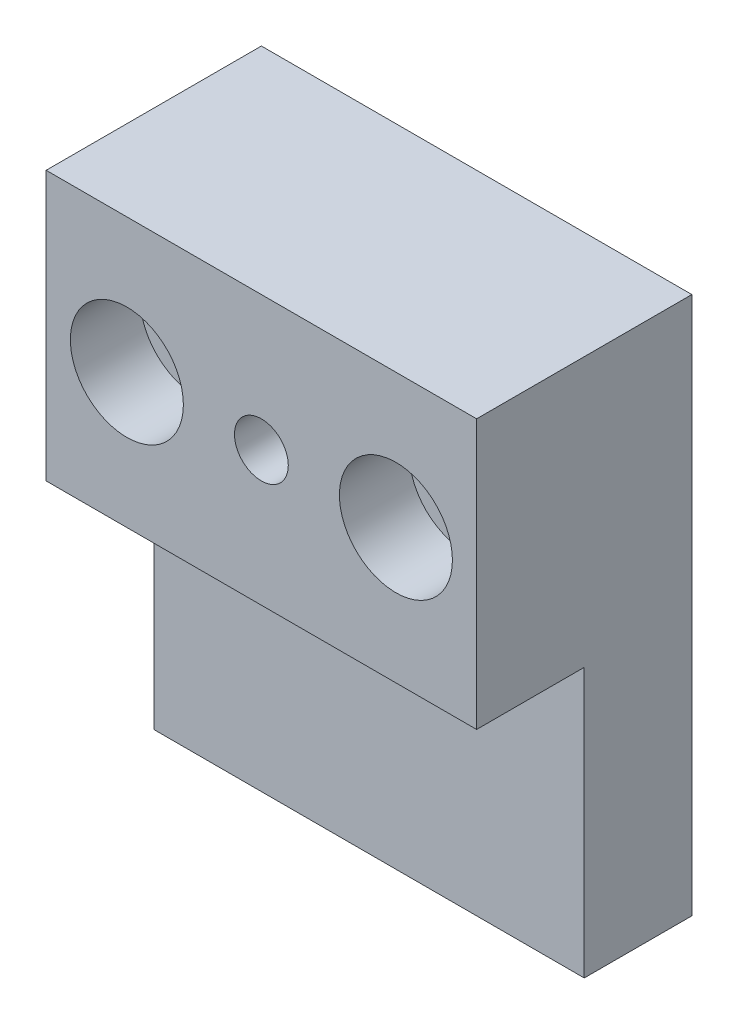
from build123d import *

# Parameters (mm, degrees)
ESQUISSE1_W             = 40
ESQUISSE1_H             = 50
EXTRUSION1_DEPTH        = 20
ESQUISSE3_W             = 40
ESQUISSE3_H             = 25
ENL_V_MAT_EXTRU_1_DEPTH = 10
PER_AGE1_D              = 6.5
PER_AGE1_DEPTH          = 25
PER_AGE1_CBORE_D        = 10.5
PER_AGE1_CBORE_DEPTH    = 6.5
PER_AGE1_TIP            = 1.952797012
TROU_TARAUD_M61_D       = 5
ESQUISSE7_R             = 6
ENL_V_MAT_EXTRU_2_DEPTH = 5
ESQUISSE8_R             = 6
ENL_V_MAT_EXTRU_3_DEPTH = 5


with BuildPart() as part:
    # Esquisse1 → Extrusion1 (new body)
    with BuildSketch(Plane.XY):
        with Locations((20, 25)):
            Rectangle(ESQUISSE1_W, ESQUISSE1_H)
    extrude(amount=EXTRUSION1_DEPTH)

    # Esquisse3 → Enl_v. mat.-Extru.1 (cut)
    with BuildSketch(Plane.XY.offset(20)):
        with Locations((20, 12.5)):
            Rectangle(ESQUISSE3_W, ESQUISSE3_H)
    extrude(amount=-ENL_V_MAT_EXTRU_1_DEPTH, mode=Mode.SUBTRACT)

    # Per_age1
    with Locations(Plane.XY.offset(20)):
        with Locations((7.5, 37.5), (32.5, 37.5)):
            CounterBoreHole(PER_AGE1_D / 2, PER_AGE1_CBORE_D / 2, PER_AGE1_CBORE_DEPTH, depth=PER_AGE1_DEPTH)
            with Locations((0, 0, -(PER_AGE1_DEPTH + PER_AGE1_TIP / 2))):  # 118° drill point
                Cone(0, PER_AGE1_D / 2, PER_AGE1_TIP, mode=Mode.SUBTRACT)

    # Trou taraud_ M61 (through all)
    with Locations(Plane(origin=(20, 37.5, 20), x_dir=(1, 0, 0), z_dir=(0, 0, 1))):
        with Locations((0, 0)):
            Hole(TROU_TARAUD_M61_D / 2)

    # Esquisse7 → Enl_v. mat.-Extru.2 (cut)
    with BuildSketch(Plane(origin=(0, 0, 0), x_dir=(-1, 0, 0), z_dir=(0, 0, -1))):
        with Locations((-32.5, 37.5)):
            Circle(ESQUISSE7_R)
    extrude(amount=-ENL_V_MAT_EXTRU_2_DEPTH, mode=Mode.SUBTRACT)

    # Esquisse8 → Enl_v. mat.-Extru.3 (cut)
    with BuildSketch(Plane(origin=(0, 0, 0), x_dir=(-1, 0, 0), z_dir=(0, 0, -1))):
        with Locations((-7.5, 37.5)):
            Circle(ESQUISSE8_R)
    extrude(amount=-ENL_V_MAT_EXTRU_3_DEPTH, mode=Mode.SUBTRACT)


solid = part.part
